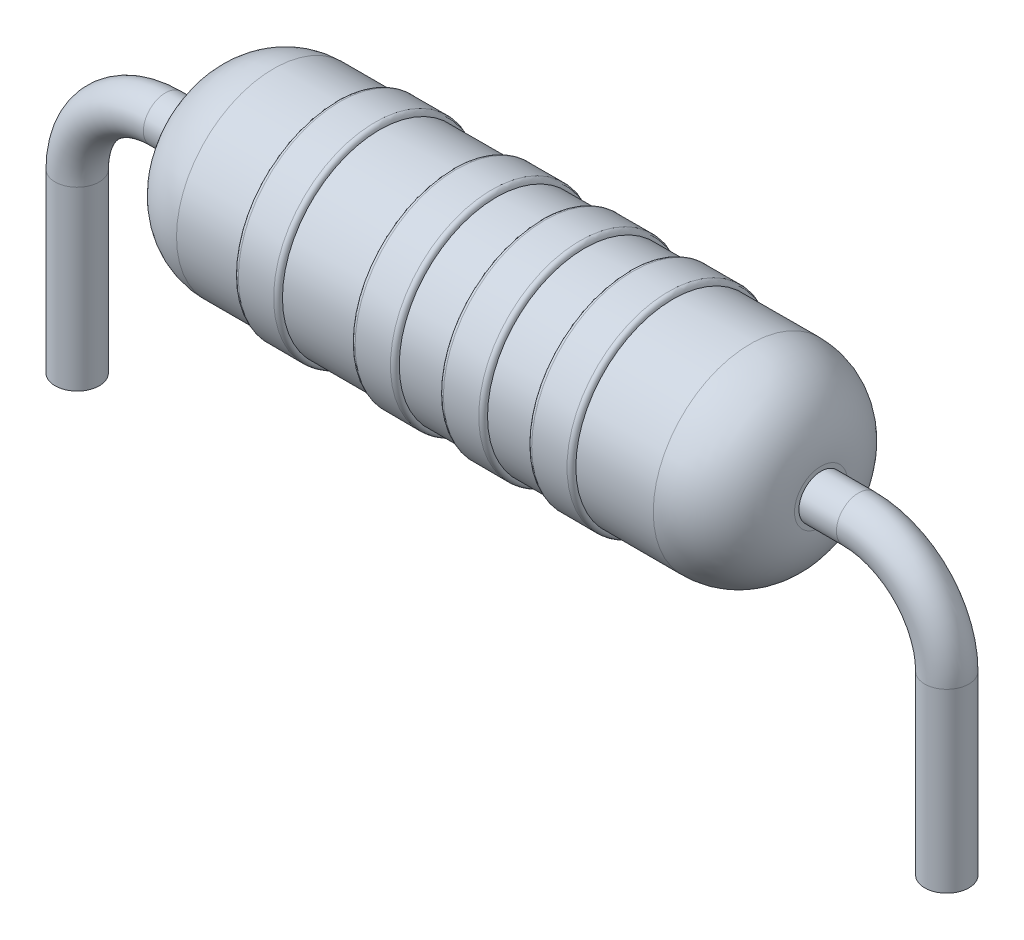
ISO-10303-21;
HEADER;
FILE_DESCRIPTION(('STEP AP214'),'2;1');
FILE_NAME('part.step','',(''),(''),'','','');
FILE_SCHEMA(('AUTOMOTIVE_DESIGN { 1 0 10303 214 1 1 1 1 }'));
ENDSEC;
DATA;
#1=APPLICATION_CONTEXT('core data for automotive mechanical design processes');
#2=APPLICATION_PROTOCOL_DEFINITION('international standard','automotive_design',2000,#1);
#3=PRODUCT_CONTEXT('',#1,'mechanical');
#4=PRODUCT('Part','Part','',(#3));
#5=PRODUCT_RELATED_PRODUCT_CATEGORY('part','',(#4));
#6=PRODUCT_DEFINITION_FORMATION('','',#4);
#7=PRODUCT_DEFINITION_CONTEXT('part definition',#1,'design');
#8=PRODUCT_DEFINITION('design','',#6,#7);
#9=PRODUCT_DEFINITION_SHAPE('','',#8);
#10=(LENGTH_UNIT() NAMED_UNIT(*) SI_UNIT(.MILLI.,.METRE.));
#11=(NAMED_UNIT(*) PLANE_ANGLE_UNIT() SI_UNIT($,.RADIAN.));
#12=(NAMED_UNIT(*) SI_UNIT($,.STERADIAN.) SOLID_ANGLE_UNIT());
#13=UNCERTAINTY_MEASURE_WITH_UNIT(LENGTH_MEASURE(1.E-05),#10,'distance_accuracy_value','');
#14=(GEOMETRIC_REPRESENTATION_CONTEXT(3) GLOBAL_UNCERTAINTY_ASSIGNED_CONTEXT((#13)) GLOBAL_UNIT_ASSIGNED_CONTEXT((#10,
#11,#12)) REPRESENTATION_CONTEXT('',''));
#15=CARTESIAN_POINT('',(0.,0.,0.));
#16=DIRECTION('',(0.,0.,1.));
#17=DIRECTION('',(1.,0.,0.));
#18=AXIS2_PLACEMENT_3D('',#15,#16,#17);
#19=CARTESIAN_POINT('',(-3.5,0.,0.));
#20=DIRECTION('',(1.,0.,0.));
#21=DIRECTION('',(0.,0.,-1.));
#22=AXIS2_PLACEMENT_3D('',#19,#20,#21);
#23=PLANE('',#22);
#24=CARTESIAN_POINT('',(-3.5,0.,0.));
#25=DIRECTION('',(-1.,0.,0.));
#26=DIRECTION('',(0.,0.,1.));
#27=AXIS2_PLACEMENT_3D('',#24,#25,#26);
#28=CIRCLE('',#27,0.299999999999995);
#29=CARTESIAN_POINT('',(-3.5,0.,0.299999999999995));
#30=VERTEX_POINT('',#29);
#31=EDGE_CURVE('E98',#30,#30,#28,.T.);
#32=ORIENTED_EDGE('',*,*,#31,.T.);
#33=EDGE_LOOP('',(#32));
#34=FACE_BOUND('',#33,.T.);
#35=CARTESIAN_POINT('',(-3.5,0.,0.));
#36=DIRECTION('',(1.,0.,0.));
#37=DIRECTION('',(0.,0.,-1.));
#38=AXIS2_PLACEMENT_3D('',#35,#36,#37);
#39=CIRCLE('',#38,0.25);
#40=CARTESIAN_POINT('',(-3.5,0.,-0.25));
#41=VERTEX_POINT('',#40);
#42=EDGE_CURVE('E10',#41,#41,#39,.F.);
#43=ORIENTED_EDGE('',*,*,#42,.F.);
#44=EDGE_LOOP('',(#43));
#45=FACE_BOUND('',#44,.T.);
#46=ADVANCED_FACE('F39',(#34,#45),#23,.F.);
#47=CARTESIAN_POINT('',(-54.2686615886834,0.,0.));
#48=DIRECTION('',(-1.,0.,0.));
#49=DIRECTION('',(0.,0.,1.));
#50=AXIS2_PLACEMENT_3D('',#47,#48,#49);
#51=CYLINDRICAL_SURFACE('',#50,1.1);
#52=CARTESIAN_POINT('',(0.322975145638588,0.,0.));
#53=DIRECTION('',(-1.,0.,0.));
#54=DIRECTION('',(0.,0.,1.));
#55=AXIS2_PLACEMENT_3D('',#52,#53,#54);
#56=CIRCLE('',#55,1.1);
#57=CARTESIAN_POINT('',(0.322975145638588,0.,1.1));
#58=VERTEX_POINT('',#57);
#59=EDGE_CURVE('E86',#58,#58,#56,.T.);
#60=ORIENTED_EDGE('',*,*,#59,.T.);
#61=EDGE_LOOP('',(#60));
#62=FACE_BOUND('',#61,.T.);
#63=CARTESIAN_POINT('',(-0.177024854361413,0.,0.));
#64=DIRECTION('',(1.,0.,0.));
#65=DIRECTION('',(0.,0.,-1.));
#66=AXIS2_PLACEMENT_3D('',#63,#64,#65);
#67=CIRCLE('',#66,1.1);
#68=CARTESIAN_POINT('',(-0.177024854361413,0.,-1.1));
#69=VERTEX_POINT('',#68);
#70=EDGE_CURVE('E95',#69,#69,#67,.T.);
#71=ORIENTED_EDGE('',*,*,#70,.T.);
#72=EDGE_LOOP('',(#71));
#73=FACE_BOUND('',#72,.T.);
#74=ADVANCED_FACE('F150',(#62,#73),#51,.T.);
#75=CARTESIAN_POINT('',(4.3261723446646,0.,0.));
#76=DIRECTION('',(1.,0.,0.));
#77=DIRECTION('',(0.,0.,-1.));
#78=AXIS2_PLACEMENT_3D('',#75,#76,#77);
#79=CYLINDRICAL_SURFACE('',#78,1.15);
#80=CARTESIAN_POINT('',(-0.627024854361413,0.,0.));
#81=DIRECTION('',(-1.,0.,0.));
#82=DIRECTION('',(0.,0.,1.));
#83=AXIS2_PLACEMENT_3D('',#80,#81,#82);
#84=CIRCLE('',#83,1.15);
#85=CARTESIAN_POINT('',(-0.627024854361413,0.,1.15));
#86=VERTEX_POINT('',#85);
#87=EDGE_CURVE('E62',#86,#86,#84,.F.);
#88=ORIENTED_EDGE('',*,*,#87,.T.);
#89=EDGE_LOOP('',(#88));
#90=FACE_BOUND('',#89,.T.);
#91=CARTESIAN_POINT('',(-0.227024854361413,0.,0.));
#92=DIRECTION('',(1.,0.,0.));
#93=DIRECTION('',(0.,0.,-1.));
#94=AXIS2_PLACEMENT_3D('',#91,#92,#93);
#95=CIRCLE('',#94,1.15);
#96=CARTESIAN_POINT('',(-0.227024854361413,0.,-1.15));
#97=VERTEX_POINT('',#96);
#98=EDGE_CURVE('E65',#97,#97,#95,.F.);
#99=ORIENTED_EDGE('',*,*,#98,.T.);
#100=EDGE_LOOP('',(#99));
#101=FACE_BOUND('',#100,.T.);
#102=ADVANCED_FACE('F156',(#90,#101),#79,.T.);
#103=CARTESIAN_POINT('',(-1.5,0.,0.));
#104=DIRECTION('',(1.,0.,0.));
#105=DIRECTION('',(0.,0.,-1.));
#106=AXIS2_PLACEMENT_3D('',#103,#104,#105);
#107=CIRCLE('',#106,1.1);
#108=CARTESIAN_POINT('',(-1.5,0.,-1.1));
#109=VERTEX_POINT('',#108);
#110=EDGE_CURVE('E79',#109,#109,#107,.T.);
#111=ORIENTED_EDGE('',*,*,#110,.T.);
#112=EDGE_LOOP('',(#111));
#113=FACE_BOUND('',#112,.T.);
#114=CARTESIAN_POINT('',(-0.677024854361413,0.,0.));
#115=DIRECTION('',(-1.,0.,0.));
#116=DIRECTION('',(0.,0.,1.));
#117=AXIS2_PLACEMENT_3D('',#114,#115,#116);
#118=CIRCLE('',#117,1.1);
#119=CARTESIAN_POINT('',(-0.677024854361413,0.,1.1));
#120=VERTEX_POINT('',#119);
#121=EDGE_CURVE('E92',#120,#120,#118,.T.);
#122=ORIENTED_EDGE('',*,*,#121,.T.);
#123=EDGE_LOOP('',(#122));
#124=FACE_BOUND('',#123,.T.);
#125=ADVANCED_FACE('F159',(#113,#124),#51,.T.);
#126=CARTESIAN_POINT('',(4.3261723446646,0.,0.));
#127=DIRECTION('',(1.,0.,0.));
#128=DIRECTION('',(0.,0.,-1.));
#129=AXIS2_PLACEMENT_3D('',#126,#127,#128);
#130=CYLINDRICAL_SURFACE('',#129,1.15);
#131=CARTESIAN_POINT('',(0.372975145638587,0.,0.));
#132=DIRECTION('',(-1.,0.,0.));
#133=DIRECTION('',(0.,0.,1.));
#134=AXIS2_PLACEMENT_3D('',#131,#132,#133);
#135=CIRCLE('',#134,1.15);
#136=CARTESIAN_POINT('',(0.372975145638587,0.,1.15));
#137=VERTEX_POINT('',#136);
#138=EDGE_CURVE('E54',#137,#137,#135,.F.);
#139=ORIENTED_EDGE('',*,*,#138,.T.);
#140=EDGE_LOOP('',(#139));
#141=FACE_BOUND('',#140,.T.);
#142=CARTESIAN_POINT('',(0.772975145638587,0.,0.));
#143=DIRECTION('',(1.,0.,0.));
#144=DIRECTION('',(0.,0.,-1.));
#145=AXIS2_PLACEMENT_3D('',#142,#143,#144);
#146=CIRCLE('',#145,1.15);
#147=CARTESIAN_POINT('',(0.772975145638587,0.,-1.15));
#148=VERTEX_POINT('',#147);
#149=EDGE_CURVE('E59',#148,#148,#146,.F.);
#150=ORIENTED_EDGE('',*,*,#149,.T.);
#151=EDGE_LOOP('',(#150));
#152=FACE_BOUND('',#151,.T.);
#153=ADVANCED_FACE('F171',(#141,#152),#130,.T.);
#154=CARTESIAN_POINT('',(1.32297514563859,0.,0.));
#155=DIRECTION('',(-1.,0.,0.));
#156=DIRECTION('',(0.,0.,1.));
#157=AXIS2_PLACEMENT_3D('',#154,#155,#156);
#158=CIRCLE('',#157,1.1);
#159=CARTESIAN_POINT('',(1.32297514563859,0.,1.1));
#160=VERTEX_POINT('',#159);
#161=EDGE_CURVE('E78',#160,#160,#158,.T.);
#162=ORIENTED_EDGE('',*,*,#161,.T.);
#163=EDGE_LOOP('',(#162));
#164=FACE_BOUND('',#163,.T.);
#165=CARTESIAN_POINT('',(0.822975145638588,0.,0.));
#166=DIRECTION('',(1.,0.,0.));
#167=DIRECTION('',(0.,0.,-1.));
#168=AXIS2_PLACEMENT_3D('',#165,#166,#167);
#169=CIRCLE('',#168,1.1);
#170=CARTESIAN_POINT('',(0.822975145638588,0.,-1.1));
#171=VERTEX_POINT('',#170);
#172=EDGE_CURVE('E89',#171,#171,#169,.T.);
#173=ORIENTED_EDGE('',*,*,#172,.T.);
#174=EDGE_LOOP('',(#173));
#175=FACE_BOUND('',#174,.T.);
#176=ADVANCED_FACE('F160',(#164,#175),#51,.T.);
#177=CARTESIAN_POINT('',(4.3261723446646,0.,0.));
#178=DIRECTION('',(1.,0.,0.));
#179=DIRECTION('',(0.,0.,-1.));
#180=AXIS2_PLACEMENT_3D('',#177,#178,#179);
#181=CYLINDRICAL_SURFACE('',#180,1.15);
#182=CARTESIAN_POINT('',(1.37297514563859,0.,0.));
#183=DIRECTION('',(-1.,0.,0.));
#184=DIRECTION('',(0.,0.,1.));
#185=AXIS2_PLACEMENT_3D('',#182,#183,#184);
#186=CIRCLE('',#185,1.15);
#187=CARTESIAN_POINT('',(1.37297514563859,0.,1.15));
#188=VERTEX_POINT('',#187);
#189=EDGE_CURVE('E46',#188,#188,#186,.F.);
#190=ORIENTED_EDGE('',*,*,#189,.T.);
#191=EDGE_LOOP('',(#190));
#192=FACE_BOUND('',#191,.T.);
#193=CARTESIAN_POINT('',(1.77297514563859,0.,0.));
#194=DIRECTION('',(1.,0.,0.));
#195=DIRECTION('',(0.,0.,-1.));
#196=AXIS2_PLACEMENT_3D('',#193,#194,#195);
#197=CIRCLE('',#196,1.15);
#198=CARTESIAN_POINT('',(1.77297514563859,0.,-1.15));
#199=VERTEX_POINT('',#198);
#200=EDGE_CURVE('E50',#199,#199,#197,.F.);
#201=ORIENTED_EDGE('',*,*,#200,.T.);
#202=EDGE_LOOP('',(#201));
#203=FACE_BOUND('',#202,.T.);
#204=ADVANCED_FACE('F182',(#192,#203),#181,.T.);
#205=CARTESIAN_POINT('',(3.5,0.299999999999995,0.));
#206=DIRECTION('',(-1.,0.,0.));
#207=DIRECTION('',(0.,0.,1.));
#208=AXIS2_PLACEMENT_3D('',#205,#206,#207);
#209=PLANE('',#208);
#210=CARTESIAN_POINT('',(3.5,0.,0.));
#211=DIRECTION('',(-1.,0.,0.));
#212=DIRECTION('',(0.,0.,1.));
#213=AXIS2_PLACEMENT_3D('',#210,#211,#212);
#214=CIRCLE('',#213,0.25);
#215=CARTESIAN_POINT('',(3.5,0.,0.25));
#216=VERTEX_POINT('',#215);
#217=EDGE_CURVE('E128',#216,#216,#214,.T.);
#218=ORIENTED_EDGE('',*,*,#217,.T.);
#219=EDGE_LOOP('',(#218));
#220=FACE_BOUND('',#219,.T.);
#221=CARTESIAN_POINT('',(3.5,0.,0.));
#222=DIRECTION('',(-1.,0.,0.));
#223=DIRECTION('',(0.,0.,1.));
#224=AXIS2_PLACEMENT_3D('',#221,#222,#223);
#225=CIRCLE('',#224,0.299999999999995);
#226=CARTESIAN_POINT('',(3.5,0.,0.299999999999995));
#227=VERTEX_POINT('',#226);
#228=EDGE_CURVE('E74',#227,#227,#225,.T.);
#229=ORIENTED_EDGE('',*,*,#228,.F.);
#230=EDGE_LOOP('',(#229));
#231=FACE_BOUND('',#230,.T.);
#232=ADVANCED_FACE('F41',(#220,#231),#209,.F.);
#233=CARTESIAN_POINT('',(2.7,0.,0.));
#234=DIRECTION('',(-1.,0.,0.));
#235=DIRECTION('',(0.,0.,1.));
#236=AXIS2_PLACEMENT_3D('',#233,#234,#235);
#237=DEGENERATE_TOROIDAL_SURFACE('',#236,0.3,0.8,.T.);
#238=CARTESIAN_POINT('',(2.69999999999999,0.,0.));
#239=DIRECTION('',(-1.,0.,0.));
#240=DIRECTION('',(0.,0.,1.));
#241=AXIS2_PLACEMENT_3D('',#238,#239,#240);
#242=CIRCLE('',#241,1.1);
#243=CARTESIAN_POINT('',(2.69999999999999,0.,1.1));
#244=VERTEX_POINT('',#243);
#245=EDGE_CURVE('E103',#244,#244,#242,.T.);
#246=ORIENTED_EDGE('',*,*,#245,.F.);
#247=EDGE_LOOP('',(#246));
#248=FACE_BOUND('',#247,.T.);
#249=ORIENTED_EDGE('',*,*,#228,.T.);
#250=EDGE_LOOP('',(#249));
#251=FACE_BOUND('',#250,.T.);
#252=ADVANCED_FACE('F173',(#248,#251),#237,.T.);
#253=CARTESIAN_POINT('',(1.82297514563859,0.,0.));
#254=DIRECTION('',(1.,0.,0.));
#255=DIRECTION('',(0.,0.,-1.));
#256=AXIS2_PLACEMENT_3D('',#253,#254,#255);
#257=CIRCLE('',#256,1.1);
#258=CARTESIAN_POINT('',(1.82297514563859,0.,-1.1));
#259=VERTEX_POINT('',#258);
#260=EDGE_CURVE('E83',#259,#259,#257,.T.);
#261=ORIENTED_EDGE('',*,*,#260,.T.);
#262=EDGE_LOOP('',(#261));
#263=FACE_BOUND('',#262,.T.);
#264=ORIENTED_EDGE('',*,*,#245,.T.);
#265=EDGE_LOOP('',(#264));
#266=FACE_BOUND('',#265,.T.);
#267=ADVANCED_FACE('F175',(#263,#266),#51,.T.);
#268=CARTESIAN_POINT('',(4.3261723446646,0.,0.));
#269=DIRECTION('',(1.,0.,0.));
#270=DIRECTION('',(0.,0.,-1.));
#271=AXIS2_PLACEMENT_3D('',#268,#269,#270);
#272=CYLINDRICAL_SURFACE('',#271,1.15);
#273=CARTESIAN_POINT('',(-1.95,0.,0.));
#274=DIRECTION('',(-1.,0.,0.));
#275=DIRECTION('',(0.,0.,1.));
#276=AXIS2_PLACEMENT_3D('',#273,#274,#275);
#277=CIRCLE('',#276,1.15);
#278=CARTESIAN_POINT('',(-1.95,0.,1.15));
#279=VERTEX_POINT('',#278);
#280=EDGE_CURVE('E68',#279,#279,#277,.F.);
#281=ORIENTED_EDGE('',*,*,#280,.T.);
#282=EDGE_LOOP('',(#281));
#283=FACE_BOUND('',#282,.T.);
#284=CARTESIAN_POINT('',(-1.55,0.,0.));
#285=DIRECTION('',(1.,0.,0.));
#286=DIRECTION('',(0.,0.,-1.));
#287=AXIS2_PLACEMENT_3D('',#284,#285,#286);
#288=CIRCLE('',#287,1.15);
#289=CARTESIAN_POINT('',(-1.55,0.,-1.15));
#290=VERTEX_POINT('',#289);
#291=EDGE_CURVE('E71',#290,#290,#288,.F.);
#292=ORIENTED_EDGE('',*,*,#291,.T.);
#293=EDGE_LOOP('',(#292));
#294=FACE_BOUND('',#293,.T.);
#295=ADVANCED_FACE('F168',(#283,#294),#272,.T.);
#296=CARTESIAN_POINT('',(-2.7,0.,0.));
#297=DIRECTION('',(-1.,0.,0.));
#298=DIRECTION('',(0.,0.,1.));
#299=AXIS2_PLACEMENT_3D('',#296,#297,#298);
#300=DEGENERATE_TOROIDAL_SURFACE('',#299,0.3,0.8,.T.);
#301=ORIENTED_EDGE('',*,*,#31,.F.);
#302=EDGE_LOOP('',(#301));
#303=FACE_BOUND('',#302,.T.);
#304=CARTESIAN_POINT('',(-2.69999999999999,0.,0.));
#305=DIRECTION('',(-1.,0.,0.));
#306=DIRECTION('',(0.,0.,1.));
#307=AXIS2_PLACEMENT_3D('',#304,#305,#306);
#308=CIRCLE('',#307,1.1);
#309=CARTESIAN_POINT('',(-2.69999999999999,0.,1.1));
#310=VERTEX_POINT('',#309);
#311=EDGE_CURVE('E106',#310,#310,#308,.T.);
#312=ORIENTED_EDGE('',*,*,#311,.T.);
#313=EDGE_LOOP('',(#312));
#314=FACE_BOUND('',#313,.T.);
#315=ADVANCED_FACE('F165',(#303,#314),#300,.T.);
#316=CARTESIAN_POINT('',(-2.,0.,0.));
#317=DIRECTION('',(-1.,0.,0.));
#318=DIRECTION('',(0.,0.,1.));
#319=AXIS2_PLACEMENT_3D('',#316,#317,#318);
#320=CIRCLE('',#319,1.1);
#321=CARTESIAN_POINT('',(-2.,0.,1.1));
#322=VERTEX_POINT('',#321);
#323=EDGE_CURVE('E75',#322,#322,#320,.T.);
#324=ORIENTED_EDGE('',*,*,#323,.T.);
#325=EDGE_LOOP('',(#324));
#326=FACE_BOUND('',#325,.T.);
#327=ORIENTED_EDGE('',*,*,#311,.F.);
#328=EDGE_LOOP('',(#327));
#329=FACE_BOUND('',#328,.T.);
#330=ADVANCED_FACE('F167',(#326,#329),#51,.T.);
#331=CARTESIAN_POINT('',(-1.95,0.,0.));
#332=DIRECTION('',(-1.,0.,0.));
#333=DIRECTION('',(0.,0.,1.));
#334=AXIS2_PLACEMENT_3D('',#331,#332,#333);
#335=TOROIDAL_SURFACE('',#334,1.1,0.05);
#336=ORIENTED_EDGE('',*,*,#323,.F.);
#337=EDGE_LOOP('',(#336));
#338=FACE_BOUND('',#337,.T.);
#339=ORIENTED_EDGE('',*,*,#280,.F.);
#340=EDGE_LOOP('',(#339));
#341=FACE_BOUND('',#340,.T.);
#342=ADVANCED_FACE('F235',(#338,#341),#335,.T.);
#343=CARTESIAN_POINT('',(-1.55,0.,0.));
#344=DIRECTION('',(1.,0.,0.));
#345=DIRECTION('',(0.,0.,-1.));
#346=AXIS2_PLACEMENT_3D('',#343,#344,#345);
#347=TOROIDAL_SURFACE('',#346,1.1,0.05);
#348=ORIENTED_EDGE('',*,*,#291,.F.);
#349=EDGE_LOOP('',(#348));
#350=FACE_BOUND('',#349,.T.);
#351=ORIENTED_EDGE('',*,*,#110,.F.);
#352=EDGE_LOOP('',(#351));
#353=FACE_BOUND('',#352,.T.);
#354=ADVANCED_FACE('F232',(#350,#353),#347,.T.);
#355=CARTESIAN_POINT('',(-0.627024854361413,0.,0.));
#356=DIRECTION('',(-1.,0.,0.));
#357=DIRECTION('',(0.,0.,1.));
#358=AXIS2_PLACEMENT_3D('',#355,#356,#357);
#359=TOROIDAL_SURFACE('',#358,1.1,0.05);
#360=ORIENTED_EDGE('',*,*,#121,.F.);
#361=EDGE_LOOP('',(#360));
#362=FACE_BOUND('',#361,.T.);
#363=ORIENTED_EDGE('',*,*,#87,.F.);
#364=EDGE_LOOP('',(#363));
#365=FACE_BOUND('',#364,.T.);
#366=ADVANCED_FACE('F228',(#362,#365),#359,.T.);
#367=CARTESIAN_POINT('',(-0.227024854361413,0.,0.));
#368=DIRECTION('',(1.,0.,0.));
#369=DIRECTION('',(0.,0.,-1.));
#370=AXIS2_PLACEMENT_3D('',#367,#368,#369);
#371=TOROIDAL_SURFACE('',#370,1.1,0.05);
#372=ORIENTED_EDGE('',*,*,#98,.F.);
#373=EDGE_LOOP('',(#372));
#374=FACE_BOUND('',#373,.T.);
#375=ORIENTED_EDGE('',*,*,#70,.F.);
#376=EDGE_LOOP('',(#375));
#377=FACE_BOUND('',#376,.T.);
#378=ADVANCED_FACE('F221',(#374,#377),#371,.T.);
#379=CARTESIAN_POINT('',(0.372975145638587,0.,0.));
#380=DIRECTION('',(-1.,0.,0.));
#381=DIRECTION('',(0.,0.,1.));
#382=AXIS2_PLACEMENT_3D('',#379,#380,#381);
#383=TOROIDAL_SURFACE('',#382,1.1,0.05);
#384=ORIENTED_EDGE('',*,*,#59,.F.);
#385=EDGE_LOOP('',(#384));
#386=FACE_BOUND('',#385,.T.);
#387=ORIENTED_EDGE('',*,*,#138,.F.);
#388=EDGE_LOOP('',(#387));
#389=FACE_BOUND('',#388,.T.);
#390=ADVANCED_FACE('F210',(#386,#389),#383,.T.);
#391=CARTESIAN_POINT('',(0.772975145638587,0.,0.));
#392=DIRECTION('',(1.,0.,0.));
#393=DIRECTION('',(0.,0.,-1.));
#394=AXIS2_PLACEMENT_3D('',#391,#392,#393);
#395=TOROIDAL_SURFACE('',#394,1.1,0.05);
#396=ORIENTED_EDGE('',*,*,#149,.F.);
#397=EDGE_LOOP('',(#396));
#398=FACE_BOUND('',#397,.T.);
#399=ORIENTED_EDGE('',*,*,#172,.F.);
#400=EDGE_LOOP('',(#399));
#401=FACE_BOUND('',#400,.T.);
#402=ADVANCED_FACE('F206',(#398,#401),#395,.T.);
#403=CARTESIAN_POINT('',(1.37297514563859,0.,0.));
#404=DIRECTION('',(-1.,0.,0.));
#405=DIRECTION('',(0.,0.,1.));
#406=AXIS2_PLACEMENT_3D('',#403,#404,#405);
#407=TOROIDAL_SURFACE('',#406,1.1,0.05);
#408=ORIENTED_EDGE('',*,*,#161,.F.);
#409=EDGE_LOOP('',(#408));
#410=FACE_BOUND('',#409,.T.);
#411=ORIENTED_EDGE('',*,*,#189,.F.);
#412=EDGE_LOOP('',(#411));
#413=FACE_BOUND('',#412,.T.);
#414=ADVANCED_FACE('F209',(#410,#413),#407,.T.);
#415=CARTESIAN_POINT('',(1.77297514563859,0.,0.));
#416=DIRECTION('',(1.,0.,0.));
#417=DIRECTION('',(0.,0.,-1.));
#418=AXIS2_PLACEMENT_3D('',#415,#416,#417);
#419=TOROIDAL_SURFACE('',#418,1.1,0.05);
#420=ORIENTED_EDGE('',*,*,#200,.F.);
#421=EDGE_LOOP('',(#420));
#422=FACE_BOUND('',#421,.T.);
#423=ORIENTED_EDGE('',*,*,#260,.F.);
#424=EDGE_LOOP('',(#423));
#425=FACE_BOUND('',#424,.T.);
#426=ADVANCED_FACE('F218',(#422,#425),#419,.T.);
#427=CARTESIAN_POINT('',(-4.925,-1.00000000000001,0.));
#428=DIRECTION('',(0.,-1.,0.));
#429=DIRECTION('',(0.,0.,-1.));
#430=AXIS2_PLACEMENT_3D('',#427,#428,#429);
#431=CYLINDRICAL_SURFACE('',#430,0.25);
#432=CARTESIAN_POINT('',(-4.925,-1.00000000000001,0.));
#433=DIRECTION('',(0.,-1.,0.));
#434=DIRECTION('',(0.,0.,1.));
#435=AXIS2_PLACEMENT_3D('',#432,#433,#434);
#436=CIRCLE('',#435,0.25);
#437=CARTESIAN_POINT('',(-5.175,-1.00000000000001,0.));
#438=VERTEX_POINT('',#437);
#439=EDGE_CURVE('E113',#438,#438,#436,.T.);
#440=ORIENTED_EDGE('',*,*,#439,.T.);
#441=EDGE_LOOP('',(#440));
#442=FACE_BOUND('',#441,.T.);
#443=CARTESIAN_POINT('',(-4.925,-3.,0.));
#444=DIRECTION('',(0.,-1.,0.));
#445=DIRECTION('',(0.,0.,1.));
#446=AXIS2_PLACEMENT_3D('',#443,#444,#445);
#447=CIRCLE('',#446,0.25);
#448=CARTESIAN_POINT('',(-4.925,-3.,0.25));
#449=VERTEX_POINT('',#448);
#450=EDGE_CURVE('E82',#449,#449,#447,.T.);
#451=ORIENTED_EDGE('',*,*,#450,.F.);
#452=EDGE_LOOP('',(#451));
#453=FACE_BOUND('',#452,.T.);
#454=ADVANCED_FACE('F375',(#442,#453),#431,.T.);
#455=CARTESIAN_POINT('',(-3.925,-1.,0.));
#456=DIRECTION('',(0.,0.,1.));
#457=DIRECTION('',(1.,0.,0.));
#458=AXIS2_PLACEMENT_3D('',#455,#456,#457);
#459=TOROIDAL_SURFACE('',#458,1.,0.25);
#460=CARTESIAN_POINT('',(-3.92499999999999,0.,0.));
#461=DIRECTION('',(-1.,0.,0.));
#462=DIRECTION('',(0.,0.,1.));
#463=AXIS2_PLACEMENT_3D('',#460,#461,#462);
#464=CIRCLE('',#463,0.25);
#465=CARTESIAN_POINT('',(-3.92499999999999,0.25,0.));
#466=VERTEX_POINT('',#465);
#467=EDGE_CURVE('E116',#466,#466,#464,.T.);
#468=CARTESIAN_POINT('',(-3.925,-1.,0.));
#469=DIRECTION('',(0.,0.,1.));
#470=DIRECTION('',(1.,0.,0.));
#471=AXIS2_PLACEMENT_3D('',#468,#469,#470);
#472=CIRCLE('',#471,1.25);
#473=EDGE_CURVE('',#466,#438,#472,.T.);
#474=ORIENTED_EDGE('',*,*,#467,.T.);
#475=ORIENTED_EDGE('',*,*,#439,.F.);
#476=ORIENTED_EDGE('',*,*,#473,.T.);
#477=ORIENTED_EDGE('',*,*,#473,.F.);
#478=EDGE_LOOP('',(#474,#476,#475,#477));
#479=FACE_BOUND('',#478,.T.);
#480=ADVANCED_FACE('F389',(#479),#459,.T.);
#481=CARTESIAN_POINT('',(-3.92499999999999,0.,0.));
#482=DIRECTION('',(1.,0.,0.));
#483=DIRECTION('',(0.,0.,-1.));
#484=AXIS2_PLACEMENT_3D('',#481,#482,#483);
#485=CYLINDRICAL_SURFACE('',#484,0.25);
#486=ORIENTED_EDGE('',*,*,#467,.F.);
#487=EDGE_LOOP('',(#486));
#488=FACE_BOUND('',#487,.T.);
#489=ORIENTED_EDGE('',*,*,#42,.T.);
#490=EDGE_LOOP('',(#489));
#491=FACE_BOUND('',#490,.T.);
#492=ADVANCED_FACE('F399',(#488,#491),#485,.T.);
#493=CARTESIAN_POINT('',(-4.925,-3.,0.));
#494=DIRECTION('',(0.,-1.,0.));
#495=DIRECTION('',(0.,0.,1.));
#496=AXIS2_PLACEMENT_3D('',#493,#494,#495);
#497=PLANE('',#496);
#498=ORIENTED_EDGE('',*,*,#450,.T.);
#499=EDGE_LOOP('',(#498));
#500=FACE_BOUND('',#499,.T.);
#501=ADVANCED_FACE('F409',(#500),#497,.T.);
#502=CARTESIAN_POINT('',(4.925,-1.00000000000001,0.));
#503=DIRECTION('',(0.,-1.,0.));
#504=DIRECTION('',(0.,0.,-1.));
#505=AXIS2_PLACEMENT_3D('',#502,#503,#504);
#506=CYLINDRICAL_SURFACE('',#505,0.25);
#507=CARTESIAN_POINT('',(4.925,-1.00000000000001,0.));
#508=DIRECTION('',(0.,1.,0.));
#509=DIRECTION('',(0.,0.,1.));
#510=AXIS2_PLACEMENT_3D('',#507,#508,#509);
#511=CIRCLE('',#510,0.25);
#512=CARTESIAN_POINT('',(5.175,-1.00000000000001,0.));
#513=VERTEX_POINT('',#512);
#514=EDGE_CURVE('E122',#513,#513,#511,.T.);
#515=ORIENTED_EDGE('',*,*,#514,.F.);
#516=EDGE_LOOP('',(#515));
#517=FACE_BOUND('',#516,.T.);
#518=CARTESIAN_POINT('',(4.925,-3.,0.));
#519=DIRECTION('',(0.,1.,0.));
#520=DIRECTION('',(0.,0.,1.));
#521=AXIS2_PLACEMENT_3D('',#518,#519,#520);
#522=CIRCLE('',#521,0.25);
#523=CARTESIAN_POINT('',(4.925,-3.,0.25));
#524=VERTEX_POINT('',#523);
#525=EDGE_CURVE('E119',#524,#524,#522,.T.);
#526=ORIENTED_EDGE('',*,*,#525,.T.);
#527=EDGE_LOOP('',(#526));
#528=FACE_BOUND('',#527,.T.);
#529=ADVANCED_FACE('F146',(#517,#528),#506,.T.);
#530=CARTESIAN_POINT('',(3.925,-1.,0.));
#531=DIRECTION('',(0.,0.,-1.));
#532=DIRECTION('',(-1.,0.,0.));
#533=AXIS2_PLACEMENT_3D('',#530,#531,#532);
#534=TOROIDAL_SURFACE('',#533,1.,0.25);
#535=CARTESIAN_POINT('',(3.92499999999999,0.,0.));
#536=DIRECTION('',(-1.,0.,0.));
#537=DIRECTION('',(0.,0.,1.));
#538=AXIS2_PLACEMENT_3D('',#535,#536,#537);
#539=CIRCLE('',#538,0.25);
#540=CARTESIAN_POINT('',(3.92499999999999,0.25,0.));
#541=VERTEX_POINT('',#540);
#542=EDGE_CURVE('E125',#541,#541,#539,.T.);
#543=CARTESIAN_POINT('',(3.925,-1.,0.));
#544=DIRECTION('',(0.,0.,-1.));
#545=DIRECTION('',(-1.,0.,0.));
#546=AXIS2_PLACEMENT_3D('',#543,#544,#545);
#547=CIRCLE('',#546,1.25);
#548=EDGE_CURVE('',#541,#513,#547,.T.);
#549=ORIENTED_EDGE('',*,*,#542,.F.);
#550=ORIENTED_EDGE('',*,*,#514,.T.);
#551=ORIENTED_EDGE('',*,*,#548,.T.);
#552=ORIENTED_EDGE('',*,*,#548,.F.);
#553=EDGE_LOOP('',(#549,#551,#550,#552));
#554=FACE_BOUND('',#553,.T.);
#555=ADVANCED_FACE('F137',(#554),#534,.T.);
#556=CARTESIAN_POINT('',(3.92499999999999,0.,0.));
#557=DIRECTION('',(-1.,0.,0.));
#558=DIRECTION('',(0.,0.,1.));
#559=AXIS2_PLACEMENT_3D('',#556,#557,#558);
#560=CYLINDRICAL_SURFACE('',#559,0.25);
#561=ORIENTED_EDGE('',*,*,#542,.T.);
#562=EDGE_LOOP('',(#561));
#563=FACE_BOUND('',#562,.T.);
#564=ORIENTED_EDGE('',*,*,#217,.F.);
#565=EDGE_LOOP('',(#564));
#566=FACE_BOUND('',#565,.T.);
#567=ADVANCED_FACE('F134',(#563,#566),#560,.T.);
#568=CARTESIAN_POINT('',(4.925,-3.,0.));
#569=DIRECTION('',(0.,-1.,0.));
#570=DIRECTION('',(0.,0.,1.));
#571=AXIS2_PLACEMENT_3D('',#568,#569,#570);
#572=PLANE('',#571);
#573=ORIENTED_EDGE('',*,*,#525,.F.);
#574=EDGE_LOOP('',(#573));
#575=FACE_BOUND('',#574,.T.);
#576=ADVANCED_FACE('F136',(#575),#572,.T.);
#577=CLOSED_SHELL('',(#46,#74,#102,#125,#153,#176,#204,#232,#252,#267,#295,#315,#330,#342,#354,
#366,#378,#390,#402,#414,#426,#454,#480,#492,#501,#529,#555,#567,#576));
#578=MANIFOLD_SOLID_BREP('B2',#577);
#579=ADVANCED_BREP_SHAPE_REPRESENTATION('',(#18,#578),#14);
#580=SHAPE_DEFINITION_REPRESENTATION(#9,#579);
ENDSEC;
END-ISO-10303-21;
